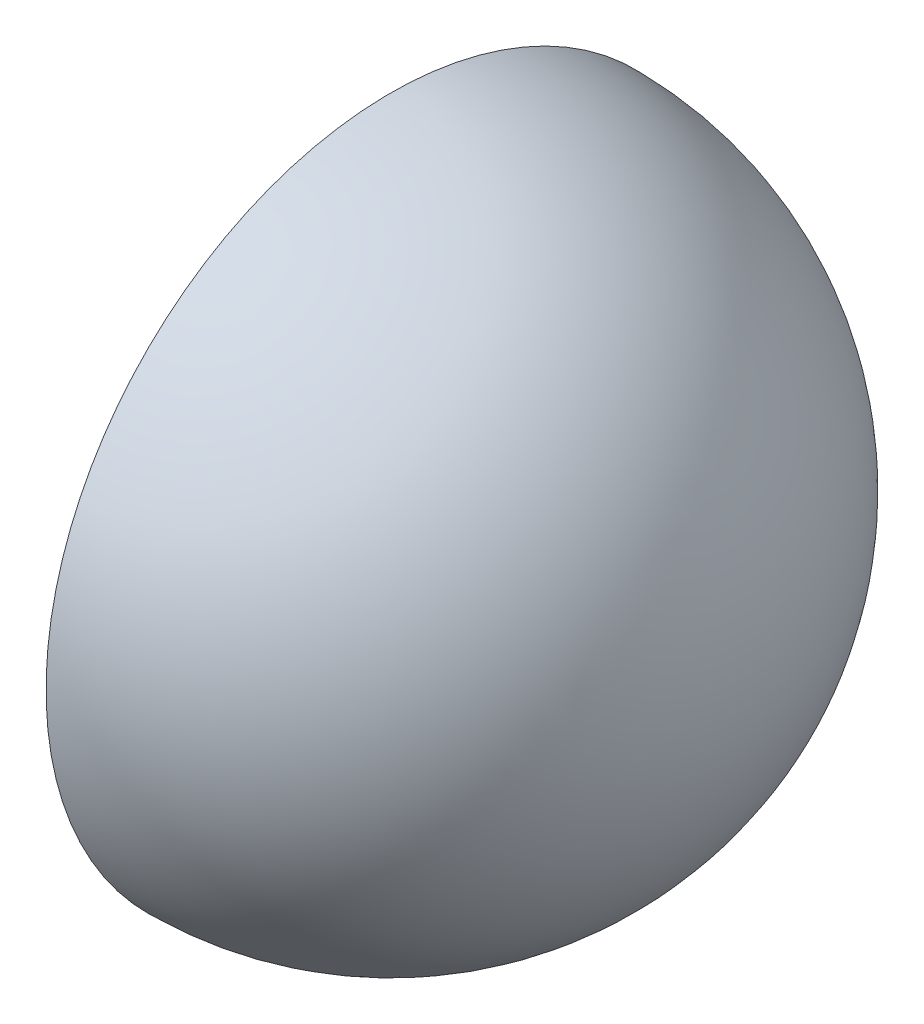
from build123d import *

# Parameters (mm, degrees)
SKETCH2_W          = 101.6
SKETCH2_H          = 101.6
CUT_EXTRUDE1_DEPTH = 88.988181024


with BuildPart() as part:
    # Sketch1 → Revolve2 (revolve)
    with BuildSketch(Plane.XY):
        with BuildLine():
            Line((0, -50.8), (0, -38.1))
            ThreePointArc((0, -38.1), (-38.1, 0), (0, 38.1))
            Line((0, 38.1), (0, 50.8))
            ThreePointArc((0, 50.8), (-50.8, 0), (0, -50.8))
        make_face()
    revolve(axis=Axis((0, -50.8, 0), (0, 1, 0)))

    # Sketch2 → Cut-Extrude1 (cut, through all)
    with BuildSketch(Plane(origin=(0, 0, 0), x_dir=(0, 0, -1), z_dir=(1, 0, 0))):
        Rectangle(SKETCH2_W, SKETCH2_H)
    extrude(amount=-CUT_EXTRUDE1_DEPTH, mode=Mode.SUBTRACT)


solid = part.part
